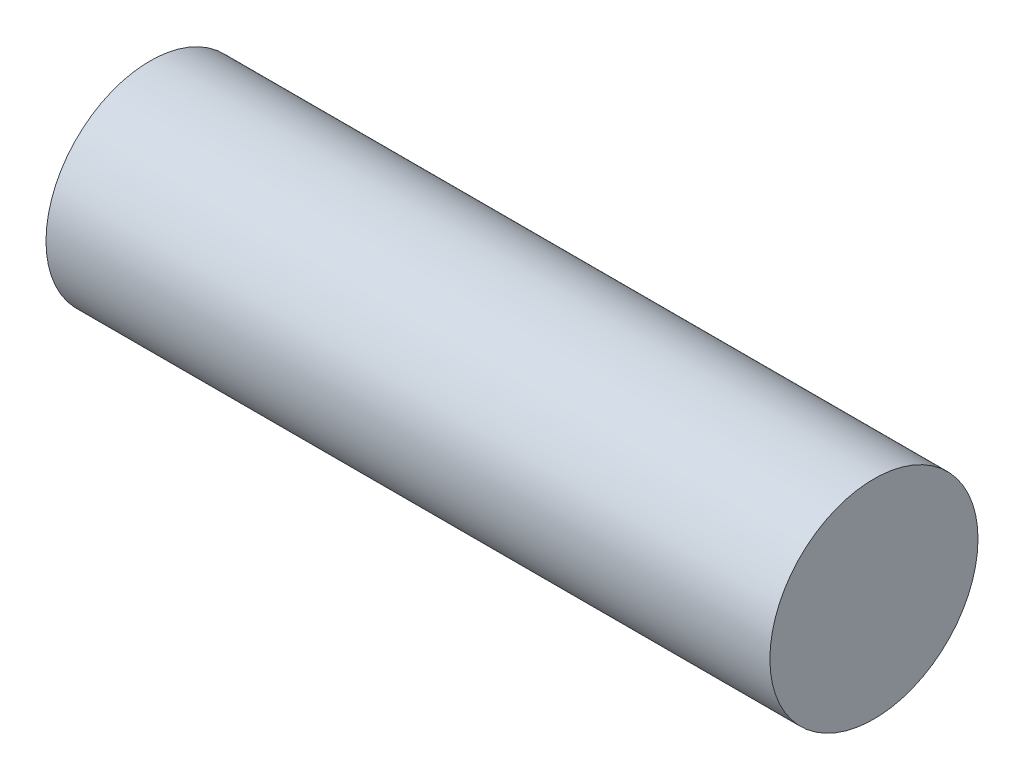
ISO-10303-21;
HEADER;
FILE_DESCRIPTION(('STEP AP214'),'2;1');
FILE_NAME('part.step','',(''),(''),'','','');
FILE_SCHEMA(('AUTOMOTIVE_DESIGN { 1 0 10303 214 1 1 1 1 }'));
ENDSEC;
DATA;
#1=APPLICATION_CONTEXT('core data for automotive mechanical design processes');
#2=APPLICATION_PROTOCOL_DEFINITION('international standard','automotive_design',2000,#1);
#3=PRODUCT_CONTEXT('',#1,'mechanical');
#4=PRODUCT('Part','Part','',(#3));
#5=PRODUCT_RELATED_PRODUCT_CATEGORY('part','',(#4));
#6=PRODUCT_DEFINITION_FORMATION('','',#4);
#7=PRODUCT_DEFINITION_CONTEXT('part definition',#1,'design');
#8=PRODUCT_DEFINITION('design','',#6,#7);
#9=PRODUCT_DEFINITION_SHAPE('','',#8);
#10=(LENGTH_UNIT() NAMED_UNIT(*) SI_UNIT(.MILLI.,.METRE.));
#11=(NAMED_UNIT(*) PLANE_ANGLE_UNIT() SI_UNIT($,.RADIAN.));
#12=(NAMED_UNIT(*) SI_UNIT($,.STERADIAN.) SOLID_ANGLE_UNIT());
#13=UNCERTAINTY_MEASURE_WITH_UNIT(LENGTH_MEASURE(1.E-05),#10,'distance_accuracy_value','');
#14=(GEOMETRIC_REPRESENTATION_CONTEXT(3) GLOBAL_UNCERTAINTY_ASSIGNED_CONTEXT((#13)) GLOBAL_UNIT_ASSIGNED_CONTEXT((#10,
#11,#12)) REPRESENTATION_CONTEXT('',''));
#15=CARTESIAN_POINT('',(0.,0.,0.));
#16=DIRECTION('',(0.,0.,1.));
#17=DIRECTION('',(1.,0.,0.));
#18=AXIS2_PLACEMENT_3D('',#15,#16,#17);
#19=CARTESIAN_POINT('',(5.08,0.,0.));
#20=DIRECTION('',(-1.,0.,0.));
#21=DIRECTION('',(0.,0.,1.));
#22=AXIS2_PLACEMENT_3D('',#19,#20,#21);
#23=CYLINDRICAL_SURFACE('',#22,1.4605);
#24=CARTESIAN_POINT('',(5.08,0.,0.));
#25=DIRECTION('',(1.,0.,0.));
#26=DIRECTION('',(0.,0.,-1.));
#27=AXIS2_PLACEMENT_3D('',#24,#25,#26);
#28=CIRCLE('',#27,1.4605);
#29=CARTESIAN_POINT('',(5.08,0.,-1.4605));
#30=VERTEX_POINT('',#29);
#31=EDGE_CURVE('E10',#30,#30,#28,.T.);
#32=ORIENTED_EDGE('',*,*,#31,.F.);
#33=EDGE_LOOP('',(#32));
#34=FACE_BOUND('',#33,.T.);
#35=CARTESIAN_POINT('',(-5.08,0.,0.));
#36=DIRECTION('',(1.,0.,0.));
#37=DIRECTION('',(0.,0.,-1.));
#38=AXIS2_PLACEMENT_3D('',#35,#36,#37);
#39=CIRCLE('',#38,1.4605);
#40=CARTESIAN_POINT('',(-5.08,0.,-1.4605));
#41=VERTEX_POINT('',#40);
#42=EDGE_CURVE('E39',#41,#41,#39,.T.);
#43=ORIENTED_EDGE('',*,*,#42,.T.);
#44=EDGE_LOOP('',(#43));
#45=FACE_BOUND('',#44,.T.);
#46=ADVANCED_FACE('F36',(#34,#45),#23,.T.);
#47=CARTESIAN_POINT('',(5.08,0.,0.));
#48=DIRECTION('',(1.,0.,0.));
#49=DIRECTION('',(0.,0.,-1.));
#50=AXIS2_PLACEMENT_3D('',#47,#48,#49);
#51=PLANE('',#50);
#52=ORIENTED_EDGE('',*,*,#31,.T.);
#53=EDGE_LOOP('',(#52));
#54=FACE_BOUND('',#53,.T.);
#55=ADVANCED_FACE('F51',(#54),#51,.T.);
#56=CARTESIAN_POINT('',(-5.08,0.,0.));
#57=DIRECTION('',(1.,0.,0.));
#58=DIRECTION('',(0.,0.,-1.));
#59=AXIS2_PLACEMENT_3D('',#56,#57,#58);
#60=PLANE('',#59);
#61=ORIENTED_EDGE('',*,*,#42,.F.);
#62=EDGE_LOOP('',(#61));
#63=FACE_BOUND('',#62,.T.);
#64=ADVANCED_FACE('F49',(#63),#60,.F.);
#65=CLOSED_SHELL('',(#46,#55,#64));
#66=MANIFOLD_SOLID_BREP('B2',#65);
#67=ADVANCED_BREP_SHAPE_REPRESENTATION('',(#18,#66),#14);
#68=SHAPE_DEFINITION_REPRESENTATION(#9,#67);
ENDSEC;
END-ISO-10303-21;
